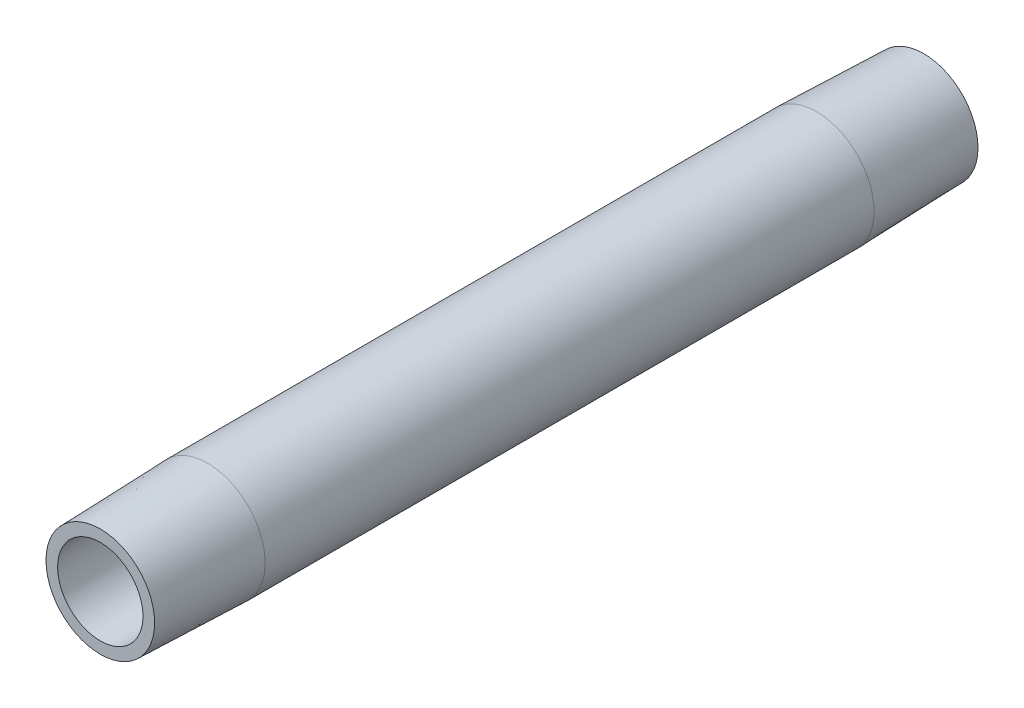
ISO-10303-21;
HEADER;
FILE_DESCRIPTION(('STEP AP214'),'2;1');
FILE_NAME('part.step','',(''),(''),'','','');
FILE_SCHEMA(('AUTOMOTIVE_DESIGN { 1 0 10303 214 1 1 1 1 }'));
ENDSEC;
DATA;
#1=APPLICATION_CONTEXT('core data for automotive mechanical design processes');
#2=APPLICATION_PROTOCOL_DEFINITION('international standard','automotive_design',2000,#1);
#3=PRODUCT_CONTEXT('',#1,'mechanical');
#4=PRODUCT('Part','Part','',(#3));
#5=PRODUCT_RELATED_PRODUCT_CATEGORY('part','',(#4));
#6=PRODUCT_DEFINITION_FORMATION('','',#4);
#7=PRODUCT_DEFINITION_CONTEXT('part definition',#1,'design');
#8=PRODUCT_DEFINITION('design','',#6,#7);
#9=PRODUCT_DEFINITION_SHAPE('','',#8);
#10=(LENGTH_UNIT() NAMED_UNIT(*) SI_UNIT(.MILLI.,.METRE.));
#11=(NAMED_UNIT(*) PLANE_ANGLE_UNIT() SI_UNIT($,.RADIAN.));
#12=(NAMED_UNIT(*) SI_UNIT($,.STERADIAN.) SOLID_ANGLE_UNIT());
#13=UNCERTAINTY_MEASURE_WITH_UNIT(LENGTH_MEASURE(1.E-05),#10,'distance_accuracy_value','');
#14=(GEOMETRIC_REPRESENTATION_CONTEXT(3) GLOBAL_UNCERTAINTY_ASSIGNED_CONTEXT((#13)) GLOBAL_UNIT_ASSIGNED_CONTEXT((#10,
#11,#12)) REPRESENTATION_CONTEXT('',''));
#15=CARTESIAN_POINT('',(0.,0.,0.));
#16=DIRECTION('',(0.,0.,1.));
#17=DIRECTION('',(1.,0.,0.));
#18=AXIS2_PLACEMENT_3D('',#15,#16,#17);
#19=CARTESIAN_POINT('',(0.,0.,0.));
#20=DIRECTION('',(0.,0.,1.));
#21=DIRECTION('',(1.,0.,0.));
#22=AXIS2_PLACEMENT_3D('',#19,#20,#21);
#23=PLANE('',#22);
#24=CARTESIAN_POINT('',(0.,0.,0.));
#25=DIRECTION('',(0.,0.,1.));
#26=DIRECTION('',(1.,0.,0.));
#27=AXIS2_PLACEMENT_3D('',#24,#25,#26);
#28=CIRCLE('',#27,7.8994);
#29=CARTESIAN_POINT('',(-7.8994,0.,0.));
#30=VERTEX_POINT('',#29);
#31=EDGE_CURVE('E33',#30,#30,#28,.T.);
#32=ORIENTED_EDGE('',*,*,#31,.T.);
#33=EDGE_LOOP('',(#32));
#34=FACE_BOUND('',#33,.T.);
#35=CARTESIAN_POINT('',(0.,0.,0.));
#36=DIRECTION('',(0.,0.,1.));
#37=DIRECTION('',(1.,0.,0.));
#38=AXIS2_PLACEMENT_3D('',#35,#36,#37);
#39=CIRCLE('',#38,10.0499652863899);
#40=CARTESIAN_POINT('',(10.0499652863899,0.,0.));
#41=VERTEX_POINT('',#40);
#42=EDGE_CURVE('E50',#41,#41,#39,.T.);
#43=ORIENTED_EDGE('',*,*,#42,.F.);
#44=EDGE_LOOP('',(#43));
#45=FACE_BOUND('',#44,.T.);
#46=ADVANCED_FACE('F29',(#34,#45),#23,.F.);
#47=CARTESIAN_POINT('',(0.,0.,152.4));
#48=DIRECTION('',(0.,0.,-1.));
#49=DIRECTION('',(-1.,0.,0.));
#50=AXIS2_PLACEMENT_3D('',#47,#48,#49);
#51=CYLINDRICAL_SURFACE('',#50,10.668);
#52=CARTESIAN_POINT('',(0.,0.,132.5499));
#53=DIRECTION('',(0.,0.,1.));
#54=DIRECTION('',(1.,0.,0.));
#55=AXIS2_PLACEMENT_3D('',#52,#53,#54);
#56=CIRCLE('',#55,10.668);
#57=CARTESIAN_POINT('',(-10.668,0.,132.5499));
#58=VERTEX_POINT('',#57);
#59=EDGE_CURVE('E44',#58,#58,#56,.T.);
#60=CARTESIAN_POINT('',(0.,0.,19.8501));
#61=DIRECTION('',(0.,0.,1.));
#62=DIRECTION('',(1.,0.,0.));
#63=AXIS2_PLACEMENT_3D('',#60,#61,#62);
#64=CIRCLE('',#63,10.668);
#65=CARTESIAN_POINT('',(-10.668,0.,19.8501));
#66=VERTEX_POINT('',#65);
#67=EDGE_CURVE('E47',#66,#66,#64,.T.);
#68=CARTESIAN_POINT('',(-10.668,0.,132.5499));
#69=CARTESIAN_POINT('',(-10.668,0.,131.37594375));
#70=CARTESIAN_POINT('',(-10.668,0.,130.2019875));
#71=CARTESIAN_POINT('',(-10.668,0.,127.854075));
#72=CARTESIAN_POINT('',(-10.668,0.,126.68011875));
#73=CARTESIAN_POINT('',(-10.668,0.,124.33220625));
#74=CARTESIAN_POINT('',(-10.668,0.,123.15825));
#75=CARTESIAN_POINT('',(-10.668,0.,120.8103375));
#76=CARTESIAN_POINT('',(-10.668,0.,119.63638125));
#77=CARTESIAN_POINT('',(-10.668,0.,117.28846875));
#78=CARTESIAN_POINT('',(-10.668,0.,116.1145125));
#79=CARTESIAN_POINT('',(-10.668,0.,113.7666));
#80=CARTESIAN_POINT('',(-10.668,0.,112.59264375));
#81=CARTESIAN_POINT('',(-10.668,0.,110.24473125));
#82=CARTESIAN_POINT('',(-10.668,0.,109.070775));
#83=CARTESIAN_POINT('',(-10.668,0.,106.7228625));
#84=CARTESIAN_POINT('',(-10.668,0.,105.54890625));
#85=CARTESIAN_POINT('',(-10.668,0.,103.20099375));
#86=CARTESIAN_POINT('',(-10.668,0.,102.0270375));
#87=CARTESIAN_POINT('',(-10.668,0.,99.679125));
#88=CARTESIAN_POINT('',(-10.668,0.,98.50516875));
#89=CARTESIAN_POINT('',(-10.668,0.,96.15725625));
#90=CARTESIAN_POINT('',(-10.668,0.,94.9833));
#91=CARTESIAN_POINT('',(-10.668,0.,92.6353875));
#92=CARTESIAN_POINT('',(-10.668,0.,91.46143125));
#93=CARTESIAN_POINT('',(-10.668,0.,89.11351875));
#94=CARTESIAN_POINT('',(-10.668,0.,87.9395625));
#95=CARTESIAN_POINT('',(-10.668,0.,85.59165));
#96=CARTESIAN_POINT('',(-10.668,0.,84.41769375));
#97=CARTESIAN_POINT('',(-10.668,0.,82.06978125));
#98=CARTESIAN_POINT('',(-10.668,0.,80.895825));
#99=CARTESIAN_POINT('',(-10.668,0.,78.5479125));
#100=CARTESIAN_POINT('',(-10.668,0.,77.37395625));
#101=CARTESIAN_POINT('',(-10.668,0.,75.02604375));
#102=CARTESIAN_POINT('',(-10.668,0.,73.8520875));
#103=CARTESIAN_POINT('',(-10.668,0.,71.504175));
#104=CARTESIAN_POINT('',(-10.668,0.,70.33021875));
#105=CARTESIAN_POINT('',(-10.668,0.,67.98230625));
#106=CARTESIAN_POINT('',(-10.668,0.,66.80835));
#107=CARTESIAN_POINT('',(-10.668,0.,64.4604375));
#108=CARTESIAN_POINT('',(-10.668,0.,63.28648125));
#109=CARTESIAN_POINT('',(-10.668,0.,60.93856875));
#110=CARTESIAN_POINT('',(-10.668,0.,59.7646125));
#111=CARTESIAN_POINT('',(-10.668,0.,57.4167));
#112=CARTESIAN_POINT('',(-10.668,0.,56.24274375));
#113=CARTESIAN_POINT('',(-10.668,0.,53.89483125));
#114=CARTESIAN_POINT('',(-10.668,0.,52.720875));
#115=CARTESIAN_POINT('',(-10.668,0.,50.3729625));
#116=CARTESIAN_POINT('',(-10.668,0.,49.19900625));
#117=CARTESIAN_POINT('',(-10.668,0.,46.85109375));
#118=CARTESIAN_POINT('',(-10.668,0.,45.6771375));
#119=CARTESIAN_POINT('',(-10.668,0.,43.329225));
#120=CARTESIAN_POINT('',(-10.668,0.,42.15526875));
#121=CARTESIAN_POINT('',(-10.668,0.,39.80735625));
#122=CARTESIAN_POINT('',(-10.668,0.,38.6334));
#123=CARTESIAN_POINT('',(-10.668,0.,36.2854875));
#124=CARTESIAN_POINT('',(-10.668,0.,35.11153125));
#125=CARTESIAN_POINT('',(-10.668,0.,32.76361875));
#126=CARTESIAN_POINT('',(-10.668,0.,31.5896625));
#127=CARTESIAN_POINT('',(-10.668,0.,29.24175));
#128=CARTESIAN_POINT('',(-10.668,0.,28.06779375));
#129=CARTESIAN_POINT('',(-10.668,0.,25.71988125));
#130=CARTESIAN_POINT('',(-10.668,0.,24.545925));
#131=CARTESIAN_POINT('',(-10.668,0.,22.1980125));
#132=CARTESIAN_POINT('',(-10.668,0.,21.02405625));
#133=CARTESIAN_POINT('',(-10.668,0.,19.8501));
#134=B_SPLINE_CURVE_WITH_KNOTS('',3,(#68,#69,#70,#71,#72,#73,#74,#75,#76,#77,#78,#79,#80,#81,
#82,#83,#84,#85,#86,#87,#88,#89,#90,#91,#92,#93,#94,#95,#96,#97,#98,#99,#100,#101,#102,#103,
#104,#105,#106,#107,#108,#109,#110,#111,#112,#113,#114,#115,#116,#117,#118,#119,#120,#121,#122,
#123,#124,#125,#126,#127,#128,#129,#130,#131,#132,#133),.UNSPECIFIED.,.F.,.F.,(4,2,2,2,2,2,2,2,
2,2,2,2,2,2,2,2,2,2,2,2,2,2,2,2,2,2,2,2,2,2,2,2,4),(0.,3.52186874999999,7.04373749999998,
10.56560625,14.087475,17.60934375,21.1312125,24.65308125,28.17495,31.69681875,35.2186875,
38.74055625,42.262425,45.78429375,49.3061625,52.82803125,56.3499,59.87176875,63.3936375,
66.91550625,70.437375,73.95924375,77.4811125,81.00298125,84.52485,88.04671875,91.5685875,
95.09045625,98.612325,102.13419375,105.6560625,109.17793125,112.6998),.UNSPECIFIED.);
#135=EDGE_CURVE('BSEAM31',#58,#66,#134,.T.);
#136=ORIENTED_EDGE('',*,*,#59,.F.);
#137=ORIENTED_EDGE('',*,*,#67,.T.);
#138=ORIENTED_EDGE('',*,*,#135,.T.);
#139=ORIENTED_EDGE('',*,*,#135,.F.);
#140=EDGE_LOOP('',(#136,#138,#137,#139));
#141=FACE_BOUND('',#140,.T.);
#142=ADVANCED_FACE('F31',(#141),#51,.T.);
#143=CARTESIAN_POINT('',(0.,0.,152.4));
#144=DIRECTION('',(0.,0.,1.));
#145=DIRECTION('',(1.,0.,0.));
#146=AXIS2_PLACEMENT_3D('',#143,#144,#145);
#147=PLANE('',#146);
#148=CARTESIAN_POINT('',(0.,0.,152.4));
#149=DIRECTION('',(0.,0.,1.));
#150=DIRECTION('',(1.,0.,0.));
#151=AXIS2_PLACEMENT_3D('',#148,#149,#150);
#152=CIRCLE('',#151,10.0499652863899);
#153=CARTESIAN_POINT('',(10.0499652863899,0.,152.4));
#154=VERTEX_POINT('',#153);
#155=EDGE_CURVE('E40',#154,#154,#152,.T.);
#156=ORIENTED_EDGE('',*,*,#155,.T.);
#157=EDGE_LOOP('',(#156));
#158=FACE_BOUND('',#157,.T.);
#159=CARTESIAN_POINT('',(0.,0.,152.4));
#160=DIRECTION('',(0.,0.,1.));
#161=DIRECTION('',(1.,0.,0.));
#162=AXIS2_PLACEMENT_3D('',#159,#160,#161);
#163=CIRCLE('',#162,7.8994);
#164=CARTESIAN_POINT('',(-7.8994,0.,152.4));
#165=VERTEX_POINT('',#164);
#166=EDGE_CURVE('E10',#165,#165,#163,.T.);
#167=ORIENTED_EDGE('',*,*,#166,.F.);
#168=EDGE_LOOP('',(#167));
#169=FACE_BOUND('',#168,.T.);
#170=ADVANCED_FACE('F62',(#158,#169),#147,.T.);
#171=CARTESIAN_POINT('',(0.,0.,152.4));
#172=DIRECTION('',(0.,0.,-1.));
#173=DIRECTION('',(-1.,0.,0.));
#174=AXIS2_PLACEMENT_3D('',#171,#172,#173);
#175=CYLINDRICAL_SURFACE('',#174,7.8994);
#176=CARTESIAN_POINT('',(-7.8994,0.,152.4));
#177=CARTESIAN_POINT('',(-7.8994,0.,150.8125));
#178=CARTESIAN_POINT('',(-7.8994,0.,149.225));
#179=CARTESIAN_POINT('',(-7.8994,0.,146.05));
#180=CARTESIAN_POINT('',(-7.8994,0.,144.4625));
#181=CARTESIAN_POINT('',(-7.8994,0.,141.2875));
#182=CARTESIAN_POINT('',(-7.8994,0.,139.7));
#183=CARTESIAN_POINT('',(-7.8994,0.,136.525));
#184=CARTESIAN_POINT('',(-7.8994,0.,134.9375));
#185=CARTESIAN_POINT('',(-7.8994,0.,131.7625));
#186=CARTESIAN_POINT('',(-7.8994,0.,130.175));
#187=CARTESIAN_POINT('',(-7.8994,0.,127.));
#188=CARTESIAN_POINT('',(-7.8994,0.,125.4125));
#189=CARTESIAN_POINT('',(-7.8994,0.,122.2375));
#190=CARTESIAN_POINT('',(-7.8994,0.,120.65));
#191=CARTESIAN_POINT('',(-7.8994,0.,117.475));
#192=CARTESIAN_POINT('',(-7.8994,0.,115.8875));
#193=CARTESIAN_POINT('',(-7.8994,0.,112.7125));
#194=CARTESIAN_POINT('',(-7.8994,0.,111.125));
#195=CARTESIAN_POINT('',(-7.8994,0.,107.95));
#196=CARTESIAN_POINT('',(-7.8994,0.,106.3625));
#197=CARTESIAN_POINT('',(-7.8994,0.,103.1875));
#198=CARTESIAN_POINT('',(-7.8994,0.,101.6));
#199=CARTESIAN_POINT('',(-7.8994,0.,98.425));
#200=CARTESIAN_POINT('',(-7.8994,0.,96.8375));
#201=CARTESIAN_POINT('',(-7.8994,0.,93.6625));
#202=CARTESIAN_POINT('',(-7.8994,0.,92.075));
#203=CARTESIAN_POINT('',(-7.8994,0.,88.9));
#204=CARTESIAN_POINT('',(-7.8994,0.,87.3125));
#205=CARTESIAN_POINT('',(-7.8994,0.,84.1375));
#206=CARTESIAN_POINT('',(-7.8994,0.,82.55));
#207=CARTESIAN_POINT('',(-7.8994,0.,79.375));
#208=CARTESIAN_POINT('',(-7.8994,0.,77.7875));
#209=CARTESIAN_POINT('',(-7.8994,0.,74.6125));
#210=CARTESIAN_POINT('',(-7.8994,0.,73.025));
#211=CARTESIAN_POINT('',(-7.8994,0.,69.85));
#212=CARTESIAN_POINT('',(-7.8994,0.,68.2625));
#213=CARTESIAN_POINT('',(-7.8994,0.,65.0875));
#214=CARTESIAN_POINT('',(-7.8994,0.,63.5));
#215=CARTESIAN_POINT('',(-7.8994,0.,60.325));
#216=CARTESIAN_POINT('',(-7.8994,0.,58.7375));
#217=CARTESIAN_POINT('',(-7.8994,0.,55.5625));
#218=CARTESIAN_POINT('',(-7.8994,0.,53.975));
#219=CARTESIAN_POINT('',(-7.8994,0.,50.8));
#220=CARTESIAN_POINT('',(-7.8994,0.,49.2125));
#221=CARTESIAN_POINT('',(-7.8994,0.,46.0375));
#222=CARTESIAN_POINT('',(-7.8994,0.,44.45));
#223=CARTESIAN_POINT('',(-7.8994,0.,41.275));
#224=CARTESIAN_POINT('',(-7.8994,0.,39.6875));
#225=CARTESIAN_POINT('',(-7.8994,0.,36.5125));
#226=CARTESIAN_POINT('',(-7.8994,0.,34.925));
#227=CARTESIAN_POINT('',(-7.8994,0.,31.75));
#228=CARTESIAN_POINT('',(-7.8994,0.,30.1625));
#229=CARTESIAN_POINT('',(-7.8994,0.,26.9875));
#230=CARTESIAN_POINT('',(-7.8994,0.,25.4));
#231=CARTESIAN_POINT('',(-7.8994,0.,22.225));
#232=CARTESIAN_POINT('',(-7.8994,0.,20.6375));
#233=CARTESIAN_POINT('',(-7.8994,0.,17.4625));
#234=CARTESIAN_POINT('',(-7.8994,0.,15.875));
#235=CARTESIAN_POINT('',(-7.8994,0.,12.7));
#236=CARTESIAN_POINT('',(-7.8994,0.,11.1125));
#237=CARTESIAN_POINT('',(-7.8994,0.,7.93750000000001));
#238=CARTESIAN_POINT('',(-7.8994,0.,6.35));
#239=CARTESIAN_POINT('',(-7.8994,0.,3.175));
#240=CARTESIAN_POINT('',(-7.8994,0.,1.5875));
#241=CARTESIAN_POINT('',(-7.8994,0.,0.));
#242=B_SPLINE_CURVE_WITH_KNOTS('',3,(#176,#177,#178,#179,#180,#181,#182,#183,#184,#185,#186,
#187,#188,#189,#190,#191,#192,#193,#194,#195,#196,#197,#198,#199,#200,#201,#202,#203,#204,#205,
#206,#207,#208,#209,#210,#211,#212,#213,#214,#215,#216,#217,#218,#219,#220,#221,#222,#223,#224,
#225,#226,#227,#228,#229,#230,#231,#232,#233,#234,#235,#236,#237,#238,#239,#240,#241),
.UNSPECIFIED.,.F.,.F.,(4,2,2,2,2,2,2,2,2,2,2,2,2,2,2,2,2,2,2,2,2,2,2,2,2,2,2,2,2,2,2,2,4),(0.,
4.7625,9.52500000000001,14.2875,19.05,23.8125,28.575,33.3375,38.1,42.8625,47.625,52.3875,57.15,
61.9125,66.675,71.4375,76.2,80.9625,85.725,90.4875,95.25,100.0125,104.775,109.5375,114.3,
119.0625,123.825,128.5875,133.35,138.1125,142.875,147.6375,152.4),.UNSPECIFIED.);
#243=EDGE_CURVE('BSEAM67',#165,#30,#242,.T.);
#244=ORIENTED_EDGE('',*,*,#166,.T.);
#245=ORIENTED_EDGE('',*,*,#31,.F.);
#246=ORIENTED_EDGE('',*,*,#243,.T.);
#247=ORIENTED_EDGE('',*,*,#243,.F.);
#248=EDGE_LOOP('',(#244,#246,#245,#247));
#249=FACE_BOUND('',#248,.T.);
#250=ADVANCED_FACE('F67',(#249),#175,.F.);
#251=CARTESIAN_POINT('',(0.,0.,132.5499));
#252=DIRECTION('',(0.,0.,-1.));
#253=DIRECTION('',(-1.,0.,0.));
#254=AXIS2_PLACEMENT_3D('',#251,#252,#253);
#255=CONICAL_SURFACE('',#254,10.668,0.0311250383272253);
#256=ORIENTED_EDGE('',*,*,#155,.F.);
#257=EDGE_LOOP('',(#256));
#258=FACE_BOUND('',#257,.T.);
#259=ORIENTED_EDGE('',*,*,#59,.T.);
#260=EDGE_LOOP('',(#259));
#261=FACE_BOUND('',#260,.T.);
#262=ADVANCED_FACE('F71',(#258,#261),#255,.T.);
#263=CARTESIAN_POINT('',(0.,0.,19.8501));
#264=DIRECTION('',(0.,0.,1.));
#265=DIRECTION('',(1.,0.,0.));
#266=AXIS2_PLACEMENT_3D('',#263,#264,#265);
#267=CONICAL_SURFACE('',#266,10.668,0.0311250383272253);
#268=ORIENTED_EDGE('',*,*,#42,.T.);
#269=EDGE_LOOP('',(#268));
#270=FACE_BOUND('',#269,.T.);
#271=ORIENTED_EDGE('',*,*,#67,.F.);
#272=EDGE_LOOP('',(#271));
#273=FACE_BOUND('',#272,.T.);
#274=ADVANCED_FACE('F54',(#270,#273),#267,.T.);
#275=CLOSED_SHELL('',(#46,#142,#170,#250,#262,#274));
#276=MANIFOLD_SOLID_BREP('B2',#275);
#277=ADVANCED_BREP_SHAPE_REPRESENTATION('',(#18,#276),#14);
#278=SHAPE_DEFINITION_REPRESENTATION(#9,#277);
ENDSEC;
END-ISO-10303-21;
